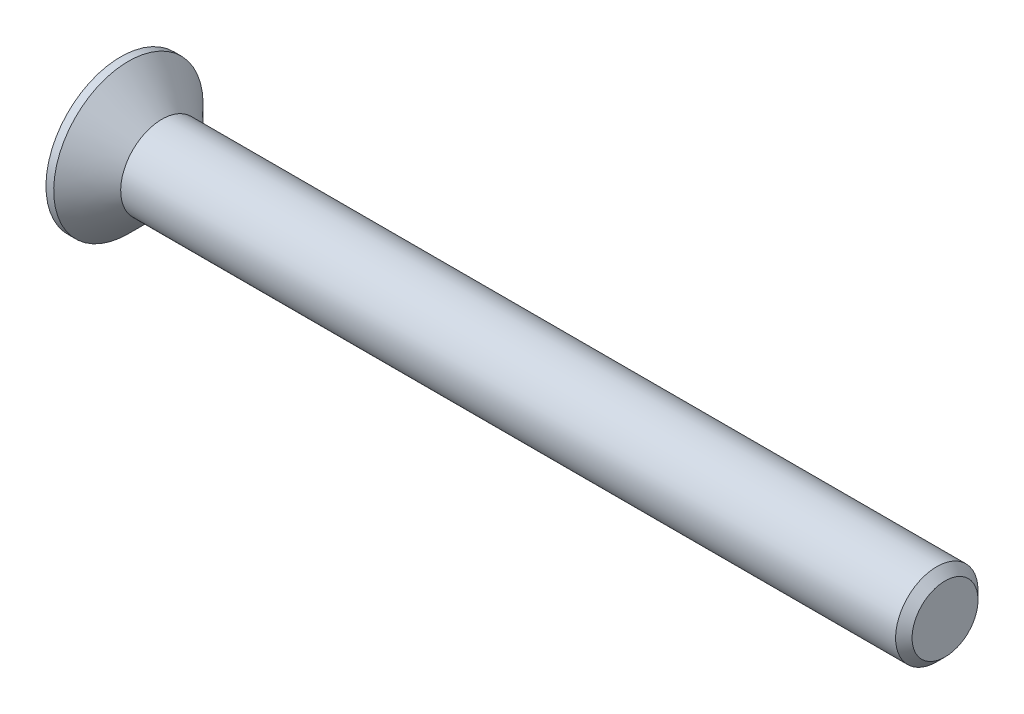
from build123d import *

# Parameters (mm, degrees)
CHAMFER1_SIZE      = 0.8
CUT_EXTRUDE1_DEPTH = 3.45


with BuildPart() as part:
    # Sketch1 → Revolve1 (revolve)
    with BuildSketch(Plane.XY, mode=Mode.PRIVATE) as revolve1_sk:
        Polygon((-4, 7.25), (-4, 0), (76, 0), (76, 4), (0, 4), (-3.25, 7.25), align=None)
    revolve(revolve1_sk.sketch.rotate(Axis((-4, 0, 0), (1, 0, 0)), 180), axis=Axis((-4, 0, 0), (1, 0, 0)))

    # Chamfer1
    chamfer1_edges = [part.edges().sort_by_distance(p)[0] for p in [
        (76, 4, 0),
    ]]
    chamfer(chamfer1_edges, length=CHAMFER1_SIZE)

    # Sketch2 → Cut-Extrude1 (cut)
    with BuildSketch(Plane.ZY.offset(4)):
        Polygon((-1.09, 4.35), (1.09, 4.35), (1.09, 1.09), (4.35, 1.09), (4.35, -1.09), (1.09, -1.09), (1.09, -4.35), (-1.09, -4.35), (-1.09, -1.09), (-4.35, -1.09), (-4.35, 1.09), (-1.09, 1.09), align=None)
    extrude(amount=-CUT_EXTRUDE1_DEPTH, mode=Mode.SUBTRACT)


solid = part.part
